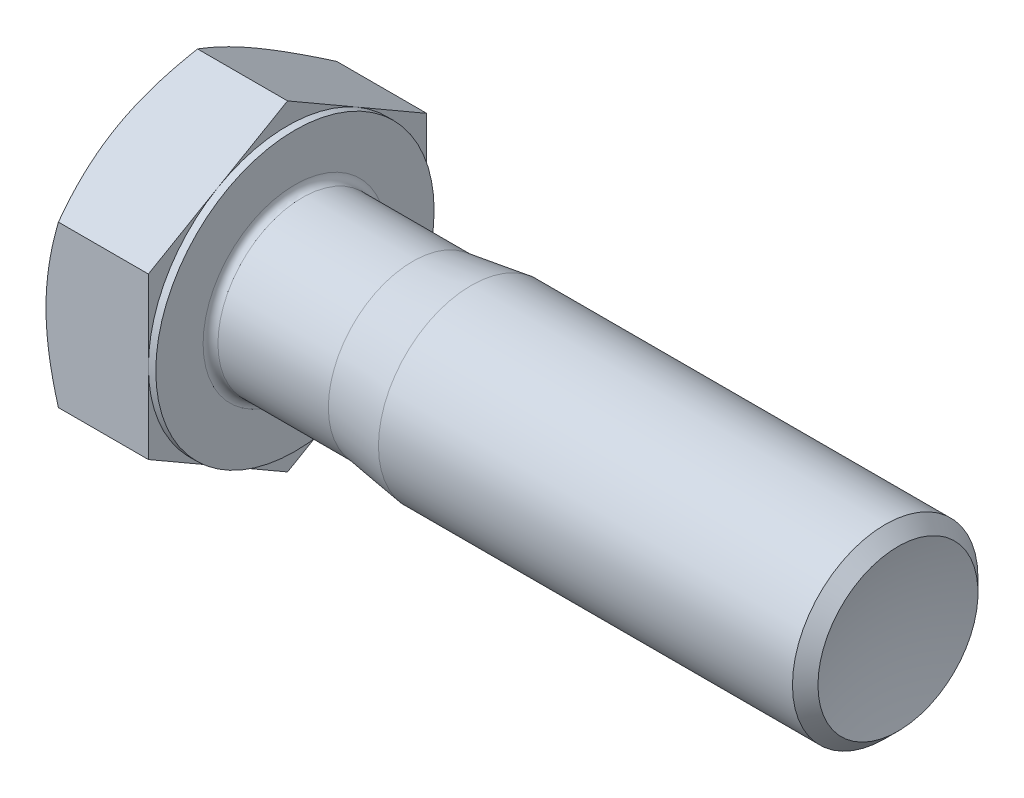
from build123d import *

# Parameters (mm, degrees)
BASEHEAD_DEPTH   = 12.5
DOME_FACE_RADIUS = 8.626
DOME_HEIGHT      = 1
CUTHEADSKE_R     = 13.85
CUTHEAD_DEPTH    = 2.5
BEARINGFACESKE_W = 0.8
BEARINGFACESKE_H = 2.320508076
FILLET_2_R       = 0.8


with BuildPart() as part:
    # BaseHeadSke → BaseHead (new body)
    with BuildSketch(Plane(origin=(0, 0, 0), x_dir=(0, 0, -1), z_dir=(1, 0, 0))):
        Polygon((15, 8.660254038), (0, 17.320508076), (-15, 8.660254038), (-15, -8.660254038), (0, -17.320508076), (15, -8.660254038), align=None)
    extrude(amount=BASEHEAD_DEPTH)

    # BodySke → BaseBody (revolve)
    with BuildSketch(Plane.XY, mode=Mode.PRIVATE) as basebody_sk:
        Polygon((0, 0), (77.5, 0), (77.5, 8.626), (76.126, 10), (31.5, 10), (25.2, 9.1), (0, 9.1), align=None)
    revolve(basebody_sk.sketch.rotate(Axis((0, 0, 0), (1, 0, 0)), 90), axis=Axis((0, 0, 0), (1, 0, 0)))

    # Dome: a dome of height H over a round flat face of radius A is a cap of a sphere of radius (A * A + H * H) / (2 * H)
    dome_r = (DOME_FACE_RADIUS * DOME_FACE_RADIUS + DOME_HEIGHT * DOME_HEIGHT) / (2 * DOME_HEIGHT)
    dome_base = Plane((77.5, 0, 0), z_dir=(-1, 0, 0))
    with Locations(dome_base.offset(DOME_HEIGHT - dome_r)):
        dome_ball = Sphere(dome_r, mode=Mode.PRIVATE)
    add(split(dome_ball, bisect_by=dome_base, keep=Keep.TOP, mode=Mode.PRIVATE), mode=Mode.SUBTRACT)

    # HeadChamferSke → HeadChamfer (revolve, cut)
    with BuildSketch(Plane.XY, mode=Mode.PRIVATE) as headchamfer_sk:
        Polygon((2.003698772, 17.320508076), (0, 17.320508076), (0, 13.85), align=None)
    revolve(headchamfer_sk.sketch.rotate(Axis((0, 0, 0), (1, 0, 0)), 90), axis=Axis((0, 0, 0), (1, 0, 0)), mode=Mode.SUBTRACT)

    # CutHeadSke → CutHead (cut)
    with BuildSketch(Plane.ZY):
        Circle(CUTHEADSKE_R)
    extrude(amount=-CUTHEAD_DEPTH, mode=Mode.SUBTRACT)

    # BearingFaceSke → BearingFace (revolve, cut)
    with BuildSketch(Plane.XY, mode=Mode.PRIVATE) as bearingface_sk:
        with Locations((12.1, 16.160254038)):
            Rectangle(BEARINGFACESKE_W, BEARINGFACESKE_H)
    revolve(bearingface_sk.sketch.rotate(Axis((0, 0, 0), (1, 0, 0)), 90), axis=Axis((0, 0, 0), (1, 0, 0)), mode=Mode.SUBTRACT)

    # Fillet 2
    fillet_2_edges = [part.edges().sort_by_distance(p)[0] for p in [
        (12.5, 0, -9.1),
    ]]
    fillet(fillet_2_edges, radius=FILLET_2_R)


solid = part.part
